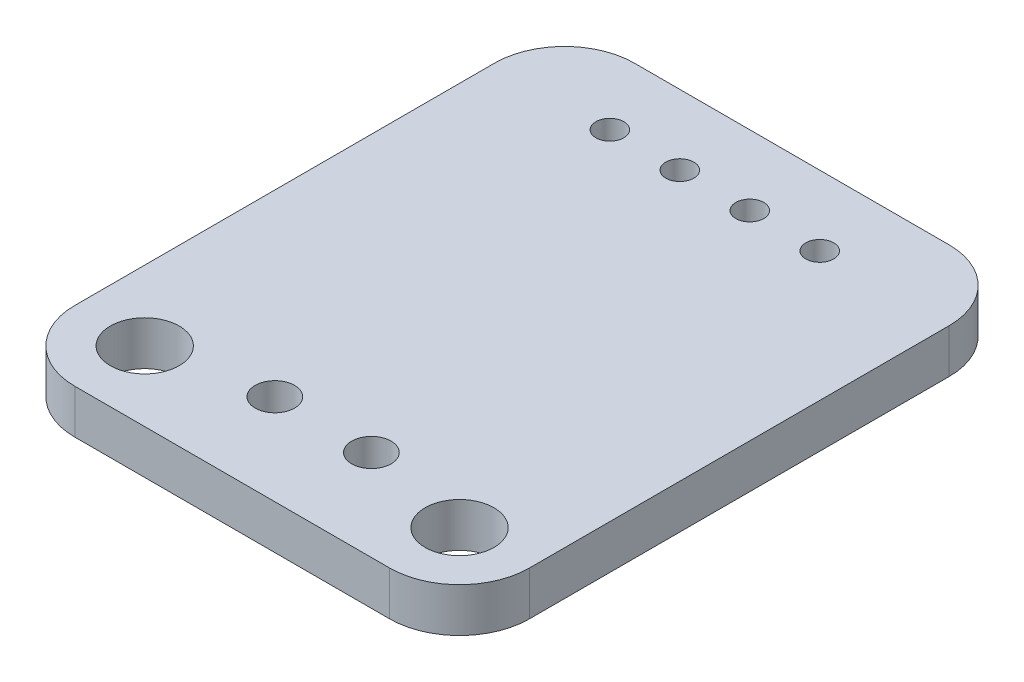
from build123d import *

# Parameters (mm, degrees)
SKETCH1_W           = 16.51
SKETCH1_H           = 20.32
BOSS_EXTRUDE1_DEPTH = 1.6002
CUT_EXTRUDE1_REACH  = 15.188
SKETCH2_R           = 1.25
CUT_EXTRUDE2_REACH  = 15.188
SKETCH3_R           = 0.508
FILLET1_R           = 2.54
CUT_EXTRUDE3_REACH  = 15.188
SKETCH4_R           = 0.716091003


with BuildPart() as part:
    # Sketch1 → Boss-Extrude1 (new body)
    with BuildSketch(Plane(origin=(0, 0, 0), x_dir=(1, 0, 0), z_dir=(0, 1, 0))):
        Rectangle(SKETCH1_W, SKETCH1_H)
    extrude(amount=BOSS_EXTRUDE1_DEPTH)

    # Sketch2 → Cut-Extrude1 (cut, up to next)
    with BuildSketch(Plane(origin=(0, 1.6002, 0), x_dir=(1, 0, 0), z_dir=(0, 1, 0)), mode=Mode.PRIVATE) as cut_extrude1_sk1:
        with Locations(Location((-5.715, -7.62, 0), (0, 0, 270))):
            Circle(SKETCH2_R)
    cut_extrude1_tool1 = extrude(cut_extrude1_sk1.sketch, amount=-CUT_EXTRUDE1_REACH, mode=Mode.PRIVATE) & part.part
    # Sketch2 → Cut-Extrude1 (cut, up to next)
    with BuildSketch(Plane(origin=(0, 1.6002, 0), x_dir=(1, 0, 0), z_dir=(0, 1, 0)), mode=Mode.PRIVATE) as cut_extrude1_sk2:
        with Locations(Location((5.715, -7.62, 0), (0, 0, 270))):
            Circle(SKETCH2_R)
    cut_extrude1_tool2 = extrude(cut_extrude1_sk2.sketch, amount=-CUT_EXTRUDE1_REACH, mode=Mode.PRIVATE) & part.part
    add(cut_extrude1_tool1.solids().sort_by_distance((-5.715, 1.6002, 7.62))[0], mode=Mode.SUBTRACT)
    add(cut_extrude1_tool2.solids().sort_by_distance((5.715, 1.6002, 7.62))[0], mode=Mode.SUBTRACT)

    # Sketch3 → Cut-Extrude2 (cut, up to next)
    with BuildSketch(Plane(origin=(0, 1.6002, 0), x_dir=(1, 0, 0), z_dir=(0, 1, 0)), mode=Mode.PRIVATE) as cut_extrude2_sk1:
        with Locations(Location((-4.066019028, 7.62, 0), (0, 0, 270))):
            Circle(SKETCH3_R)
    cut_extrude2_tool1 = extrude(cut_extrude2_sk1.sketch, amount=-CUT_EXTRUDE2_REACH, mode=Mode.PRIVATE) & part.part
    # Sketch3 → Cut-Extrude2 (cut, up to next)
    with BuildSketch(Plane(origin=(0, 1.6002, 0), x_dir=(1, 0, 0), z_dir=(0, 1, 0)), mode=Mode.PRIVATE) as cut_extrude2_sk2:
        with Locations(Location((-1.526019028, 7.62, 0), (0, 0, 270))):
            Circle(SKETCH3_R)
    cut_extrude2_tool2 = extrude(cut_extrude2_sk2.sketch, amount=-CUT_EXTRUDE2_REACH, mode=Mode.PRIVATE) & part.part
    # Sketch3 → Cut-Extrude2 (cut, up to next)
    with BuildSketch(Plane(origin=(0, 1.6002, 0), x_dir=(1, 0, 0), z_dir=(0, 1, 0)), mode=Mode.PRIVATE) as cut_extrude2_sk3:
        with Locations(Location((1.013980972, 7.62, 0), (0, 0, 270))):
            Circle(SKETCH3_R)
    cut_extrude2_tool3 = extrude(cut_extrude2_sk3.sketch, amount=-CUT_EXTRUDE2_REACH, mode=Mode.PRIVATE) & part.part
    # Sketch3 → Cut-Extrude2 (cut, up to next)
    with BuildSketch(Plane(origin=(0, 1.6002, 0), x_dir=(1, 0, 0), z_dir=(0, 1, 0)), mode=Mode.PRIVATE) as cut_extrude2_sk4:
        with Locations(Location((3.553980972, 7.62, 0), (0, 0, 270))):
            Circle(SKETCH3_R)
    cut_extrude2_tool4 = extrude(cut_extrude2_sk4.sketch, amount=-CUT_EXTRUDE2_REACH, mode=Mode.PRIVATE) & part.part
    add(cut_extrude2_tool1.solids().sort_by_distance((-4.066019, 1.6002, -7.62))[0], mode=Mode.SUBTRACT)
    add(cut_extrude2_tool2.solids().sort_by_distance((-1.526019, 1.6002, -7.62))[0], mode=Mode.SUBTRACT)
    add(cut_extrude2_tool3.solids().sort_by_distance((1.013981, 1.6002, -7.62))[0], mode=Mode.SUBTRACT)
    add(cut_extrude2_tool4.solids().sort_by_distance((3.553981, 1.6002, -7.62))[0], mode=Mode.SUBTRACT)

    # Fillet1
    fillet1_edges = [part.edges().sort_by_distance(p)[0] for p in [
        (-8.255, 0.8001, -10.16),
        (8.255, 0.8001, -10.16),
        (8.255, 0.8001, 10.16),
        (-8.255, 0.8001, 10.16),
    ]]
    fillet(fillet1_edges, radius=FILLET1_R)

    # Sketch4 → Cut-Extrude3 (cut, up to next)
    with BuildSketch(Plane(origin=(0, 1.6002, 0), x_dir=(1, 0, 0), z_dir=(0, 1, 0)), mode=Mode.PRIVATE) as cut_extrude3_sk1:
        with Locations(Location((-1.7526, -6.858, 0), (0, 0, 270))):
            Circle(SKETCH4_R)
    cut_extrude3_tool1 = extrude(cut_extrude3_sk1.sketch, amount=-CUT_EXTRUDE3_REACH, mode=Mode.PRIVATE) & part.part
    # Sketch4 → Cut-Extrude3 (cut, up to next)
    with BuildSketch(Plane(origin=(0, 1.6002, 0), x_dir=(1, 0, 0), z_dir=(0, 1, 0)), mode=Mode.PRIVATE) as cut_extrude3_sk2:
        with Locations(Location((1.7526, -6.858, 0), (0, 0, 270))):
            Circle(SKETCH4_R)
    cut_extrude3_tool2 = extrude(cut_extrude3_sk2.sketch, amount=-CUT_EXTRUDE3_REACH, mode=Mode.PRIVATE) & part.part
    add(cut_extrude3_tool1.solids().sort_by_distance((-1.7526, 1.6002, 6.858))[0], mode=Mode.SUBTRACT)
    add(cut_extrude3_tool2.solids().sort_by_distance((1.7526, 1.6002, 6.858))[0], mode=Mode.SUBTRACT)


solid = part.part
